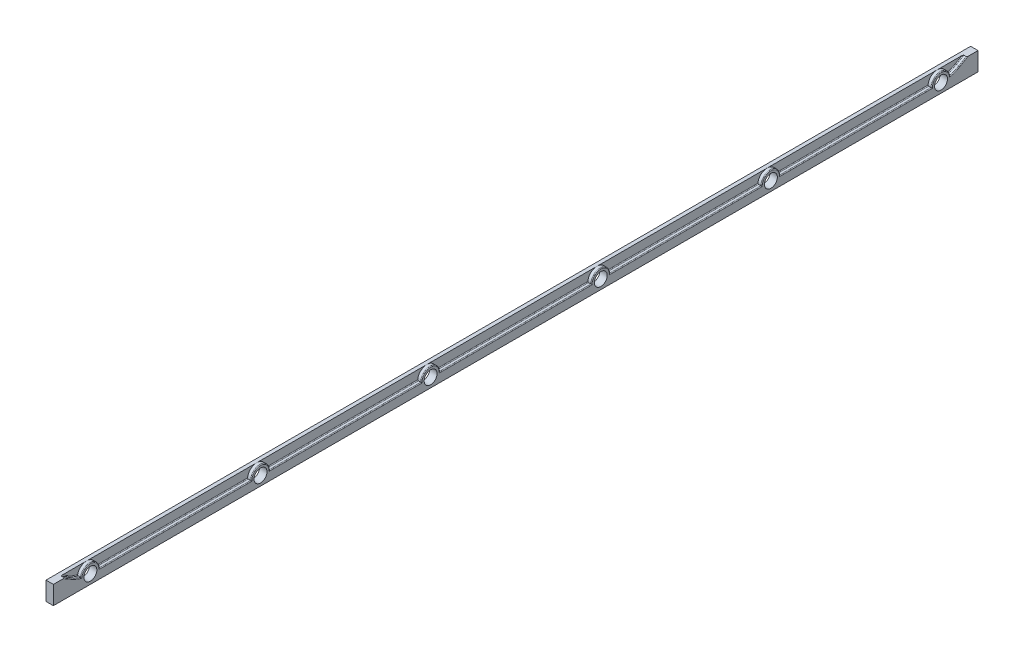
from build123d import *

# Parameters (mm, degrees)
SKETCH1_W                  = 250.00000000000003
SKETCH1_H                  = 5
BOSS_EXTRUDE1_DEPTH        = 2
CUT_EXTRUDE1_DEPTH         = 1
CUT_EXTRUDE2_DEPTH         = 0.9999999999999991
CUT_EXTRUDE3_DEPTH         = 0.9999999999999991
CUT_EXTRUDE4_DEPTH         = 0.9999999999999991
CUT_EXTRUDE5_DEPTH         = 0.9999999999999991
CUT_EXTRUDE6_DEPTH         = 0.9999999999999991
CUT_EXTRUDE7_DEPTH         = 0.9999999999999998
F_3_5_3_5_DIAMETER_HOLE1_D = 3.5
FILLET1_R                  = 0.20000000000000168


with BuildPart() as part:
    # Sketch1 → Boss-Extrude1 (new body)
    with BuildSketch(Plane(origin=(1, 0, 0), x_dir=(0, 0, -1), z_dir=(1, 0, 0))):
        Rectangle(SKETCH1_W, SKETCH1_H)
    extrude(amount=-BOSS_EXTRUDE1_DEPTH)

    # Sketch2 → Cut-Extrude1 (cut)
    with BuildSketch(Plane(origin=(1, 0, 0), x_dir=(0, 0, -1), z_dir=(1, 0, 0))):
        with BuildLine():
            Line((119.99038105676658, 1.3397459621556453), (121.99999999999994, 2.5))
            Line((121.99999999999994, 2.5), (114.99999999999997, 2.5))
            ThreePointArc((114.99999999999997, 2.5), (116.65269090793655, 1.8757965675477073), (117.48008954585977, 0.3148902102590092))
            ThreePointArc((117.48008954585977, 0.3148902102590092), (118.77013179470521, 0.741842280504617), (119.99038105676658, 1.3397459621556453))
        make_face()
    extrude(amount=-CUT_EXTRUDE1_DEPTH, mode=Mode.SUBTRACT)

    # Sketch3 → Cut-Extrude2 (cut)
    with BuildSketch(Plane(origin=(1, 0, 0), x_dir=(0, 0, -1), z_dir=(1, 0, 0))):
        with BuildLine():
            Line((114.99999999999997, 2.499999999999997), (69, 2.499999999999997))
            ThreePointArc((69, 2.499999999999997), (70.76776695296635, 1.7677669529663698), (71.49999999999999, 2.325e-14))
            Line((71.49999999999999, 2.325e-14), (112.49999999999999, 2.827e-14))
            ThreePointArc((112.49999999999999, 2.827e-14), (113.23223304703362, 1.7677669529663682), (114.99999999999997, 2.499999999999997))
        make_face()
    extrude(amount=-CUT_EXTRUDE2_DEPTH, mode=Mode.SUBTRACT)

    # Sketch4 → Cut-Extrude3 (cut)
    with BuildSketch(Plane(origin=(1, 0, 0), x_dir=(0, 0, -1), z_dir=(1, 0, 0))):
        with BuildLine():
            Line((69, 2.499999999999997), (23.000000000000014, 2.499999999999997))
            ThreePointArc((23.000000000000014, 2.499999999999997), (24.76776695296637, 1.7677669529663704), (25.500000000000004, 1.762e-14))
            Line((25.500000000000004, 1.762e-14), (66.5, 2.264e-14))
            ThreePointArc((66.5, 2.264e-14), (67.23223304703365, 1.7677669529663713), (69, 2.499999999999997))
        make_face()
    extrude(amount=-CUT_EXTRUDE3_DEPTH, mode=Mode.SUBTRACT)

    # Sketch5 → Cut-Extrude4 (cut)
    with BuildSketch(Plane(origin=(1, 0, 0), x_dir=(0, 0, -1), z_dir=(1, 0, 0))):
        with BuildLine():
            Line((23.000000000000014, 2.499999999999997), (-23.000000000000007, 2.499999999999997))
            ThreePointArc((-23.000000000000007, 2.499999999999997), (-21.232233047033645, 1.7677669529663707), (-20.50000000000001, 1.199e-14))
            Line((-20.50000000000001, 1.199e-14), (20.500000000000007, 1.701e-14))
            ThreePointArc((20.500000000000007, 1.701e-14), (21.232233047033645, 1.7677669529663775), (23.000000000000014, 2.499999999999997))
        make_face()
    extrude(amount=-CUT_EXTRUDE4_DEPTH, mode=Mode.SUBTRACT)

    # Sketch6 → Cut-Extrude5 (cut)
    with BuildSketch(Plane(origin=(1, 0, 0), x_dir=(0, 0, -1), z_dir=(1, 0, 0))):
        with BuildLine():
            Line((-23.000000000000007, 2.499999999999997), (-69, 2.499999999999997))
            ThreePointArc((-69, 2.499999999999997), (-67.23223304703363, 1.7677669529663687), (-66.50000000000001, 6.35e-15))
            Line((-66.50000000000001, 6.35e-15), (-25.500000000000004, 1.137e-14))
            ThreePointArc((-25.500000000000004, 1.137e-14), (-24.76776695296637, 1.7677669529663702), (-23.000000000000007, 2.499999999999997))
        make_face()
    extrude(amount=-CUT_EXTRUDE5_DEPTH, mode=Mode.SUBTRACT)

    # Sketch7 → Cut-Extrude6 (cut)
    with BuildSketch(Plane(origin=(1, 0, 0), x_dir=(0, 0, -1), z_dir=(1, 0, 0))):
        with BuildLine():
            Line((-69, 2.499999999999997), (-115, 2.499999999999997))
            ThreePointArc((-115, 2.499999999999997), (-113.23223304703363, 1.7677669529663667), (-112.50000000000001, 7.2e-16))
            Line((-112.50000000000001, 7.2e-16), (-71.5, 5.74e-15))
            ThreePointArc((-71.5, 5.74e-15), (-70.76776695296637, 1.7677669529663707), (-69, 2.499999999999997))
        make_face()
    extrude(amount=-CUT_EXTRUDE6_DEPTH, mode=Mode.SUBTRACT)

    # Sketch8 → Cut-Extrude7 (cut)
    with BuildSketch(Plane(origin=(1, 0, 0), x_dir=(0, 0, -1), z_dir=(1, 0, 0))):
        with BuildLine():
            Line((-115, 2.499999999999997), (-122, 2.5))
            Line((-122, 2.5), (-119.99038105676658, 1.3397459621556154))
            ThreePointArc((-119.99038105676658, 1.3397459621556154), (-118.77013179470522, 0.7418422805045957), (-117.4800895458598, 0.31489021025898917))
            ThreePointArc((-117.4800895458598, 0.31489021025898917), (-116.65269090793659, 1.8757965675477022), (-115, 2.499999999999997))
        make_face()
    extrude(amount=-CUT_EXTRUDE7_DEPTH, mode=Mode.SUBTRACT)

    # 3.5 _3.5_ Diameter Hole1 (through all)
    with Locations(Plane(origin=(1, 0, 0), x_dir=(0, 0, -1), z_dir=(1, 0, 0))):
        with Locations((-69, 0), (-23, 0), (23, 0), (69, 0), (115, 0), (-115, 0)):
            Hole(F_3_5_3_5_DIAMETER_HOLE1_D / 2)

    # Fillet1
    fillet1_edges = [part.edges().sort_by_distance(p)[0] for p in [
        (2.2e-16, 0.7418422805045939, 118.77013179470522),
        (2.2e-16, 1.9198729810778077, 120.99519052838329),
        (1, 0.7418422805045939, 118.77013179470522),
        (1, 1.9198729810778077, 120.99519052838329),
        (0, 1.9198729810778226, -120.99519052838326),
        (0, 0.7418422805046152, -118.77013179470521),
        (1, 2.4950174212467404, -114.84224047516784),
        (1, 0.7418422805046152, -118.77013179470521),
        (1, 1.9198729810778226, -120.99519052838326),
        (8.9e-16, 2.576e-14, -91.99999999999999),
        (1, 2.499999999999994, -69),
        (1, 2.576e-14, -91.99999999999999),
        (8.9e-16, 2.013e-14, -46),
        (1, 2.499999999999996, -23.000000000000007),
        (1, 2.013e-14, -46),
        (8.9e-16, 1.45e-14, 3.55e-15),
        (1, 2.4999999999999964, 23.000000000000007),
        (1, 1.45e-14, 3.55e-15),
        (8.9e-16, 8.86e-15, 46.00000000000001),
        (1, 2.4999999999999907, 68.99999999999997),
        (1, 8.86e-15, 46.00000000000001),
        (8.9e-16, 3.23e-15, 92),
        (1, 2.495017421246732, 114.84224047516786),
        (1, 3.23e-15, 92),
    ]]
    fillet(fillet1_edges, radius=FILLET1_R)


solid = part.part
